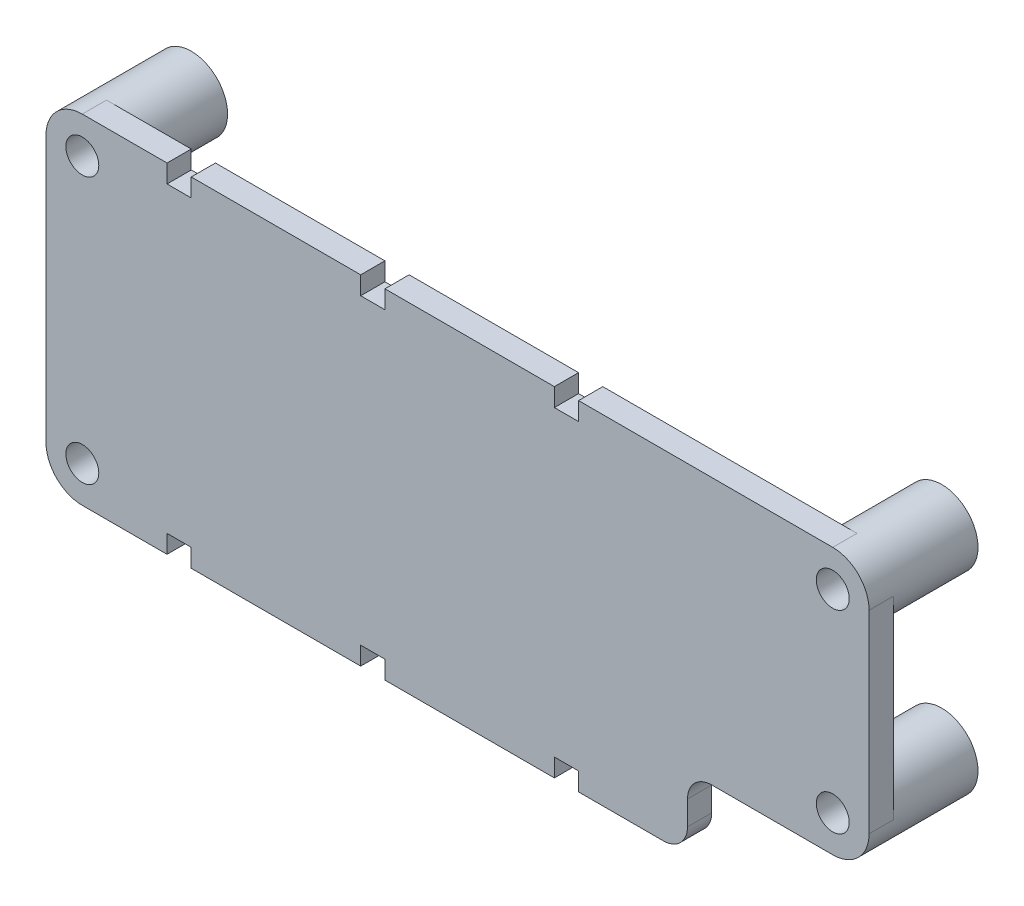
from build123d import *
from build123d.topology import SkipClean

# Parameters (mm, degrees)
SKETCH1_R             = 3.81
BOSS_EXTRUDE1_DEPTH   = 8.89
BOSS_EXTRUDE1_2_DEPTH = 8.89
BOSS_EXTRUDE1_3_DEPTH = 8.89
BOSS_EXTRUDE1_4_DEPTH = 8.89
BOSS_EXTRUDE2_DEPTH   = 2.54
F_4_CLEARANCE_HOLE1_D = 3.4544
SKETCH6_W             = 2.54
SKETCH6_H             = 1.905
CUT_EXTRUDE1_DEPTH    = 2.54


with BuildPart() as part:
    # Sketch1 → Boss-Extrude1 (new body)
    with BuildSketch(Plane.XY):
        with Locations((-27.94, 20.32)):
            Circle(SKETCH1_R)
    extrude(amount=BOSS_EXTRUDE1_DEPTH)



with BuildPart() as body_2:
    # Sketch1 → Boss-Extrude1 2 (new body)
    with BuildSketch(Plane.XY):
        with Locations((-27.94, -7.62)):
            Circle(SKETCH1_R)
    extrude(amount=BOSS_EXTRUDE1_2_DEPTH)


with BuildPart() as body_3:
    # Sketch1 → Boss-Extrude1 3 (new body)
    with BuildSketch(Plane.XY):
        with Locations((50.8, 20.32)):
            Circle(SKETCH1_R)
    extrude(amount=BOSS_EXTRUDE1_3_DEPTH)


with BuildPart() as body_4:
    # Sketch1 → Boss-Extrude1 4 (new body)
    with BuildSketch(Plane.XY):
        with Locations((50.8, 0)):
            Circle(SKETCH1_R)
    extrude(amount=BOSS_EXTRUDE1_4_DEPTH)


with BuildPart() as part_1:
    with SkipClean():  # the faces are left unmerged after this step: merging them gives an invalid solid
        add(part.part)

        add(body_2.part)  # Boss-Extrude2 merges body 2

        add(body_3.part)  # Boss-Extrude2 merges body 3

        add(body_4.part)  # Boss-Extrude2 merges body 4
        # Sketch2 → Boss-Extrude2 (add)
        with BuildSketch(Plane.XY.offset(8.89)):
            with BuildLine():
                Line((35.56, -6.35), (35.56, -8.89))
                ThreePointArc((35.56, -8.89), (34.816051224, -10.686051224), (33.02, -11.43))
                Line((33.02, -11.43), (-27.94, -11.43))
                ThreePointArc((-27.94, -11.43), (-30.634076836, -10.314076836), (-31.75, -7.62))
                Line((-31.75, -7.62), (-31.75, 20.32))
                ThreePointArc((-31.75, 20.32), (-30.634076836, 23.014076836), (-27.94, 24.13))
                Line((-27.94, 24.13), (50.8, 24.13))
                ThreePointArc((50.8, 24.13), (53.494076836, 23.014076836), (54.61, 20.32))
                Line((54.61, 20.32), (54.61, 0))
                ThreePointArc((54.61, 0), (53.494076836, -2.694076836), (50.8, -3.81))
                Line((50.8, -3.81), (38.1, -3.81))
                ThreePointArc((38.1, -3.81), (36.303948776, -4.553948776), (35.56, -6.35))
            make_face()
        extrude(amount=BOSS_EXTRUDE2_DEPTH)

    # 4 Clearance Hole1 (through all)
    with Locations(Plane.XY.offset(11.43)):
        with Locations((-27.94, 20.32), (-27.94, -7.62), (50.8, 0), (50.8, 20.32)):
            Hole(F_4_CLEARANCE_HOLE1_D / 2)

    # Sketch6 → Cut-Extrude1 (cut)
    with SkipClean():  # the faces are left unmerged after this step: merging them gives an invalid solid
        with BuildSketch(Plane.XY.offset(11.43)):
            with Locations((22.86, -10.4775)):
                Rectangle(SKETCH6_W, SKETCH6_H)
            with Locations((-17.78, 23.1775)):
                Rectangle(SKETCH6_W, SKETCH6_H)
            with Locations((2.54, 23.1775)):
                Rectangle(SKETCH6_W, SKETCH6_H)
            with Locations((-17.78, -10.4775)):
                Rectangle(SKETCH6_W, SKETCH6_H)
            with Locations((2.54, -10.4775)):
                Rectangle(SKETCH6_W, SKETCH6_H)
            with Locations((22.86, 23.1775)):
                Rectangle(SKETCH6_W, SKETCH6_H)
        extrude(amount=-CUT_EXTRUDE1_DEPTH, mode=Mode.SUBTRACT)


solid = part_1.part
